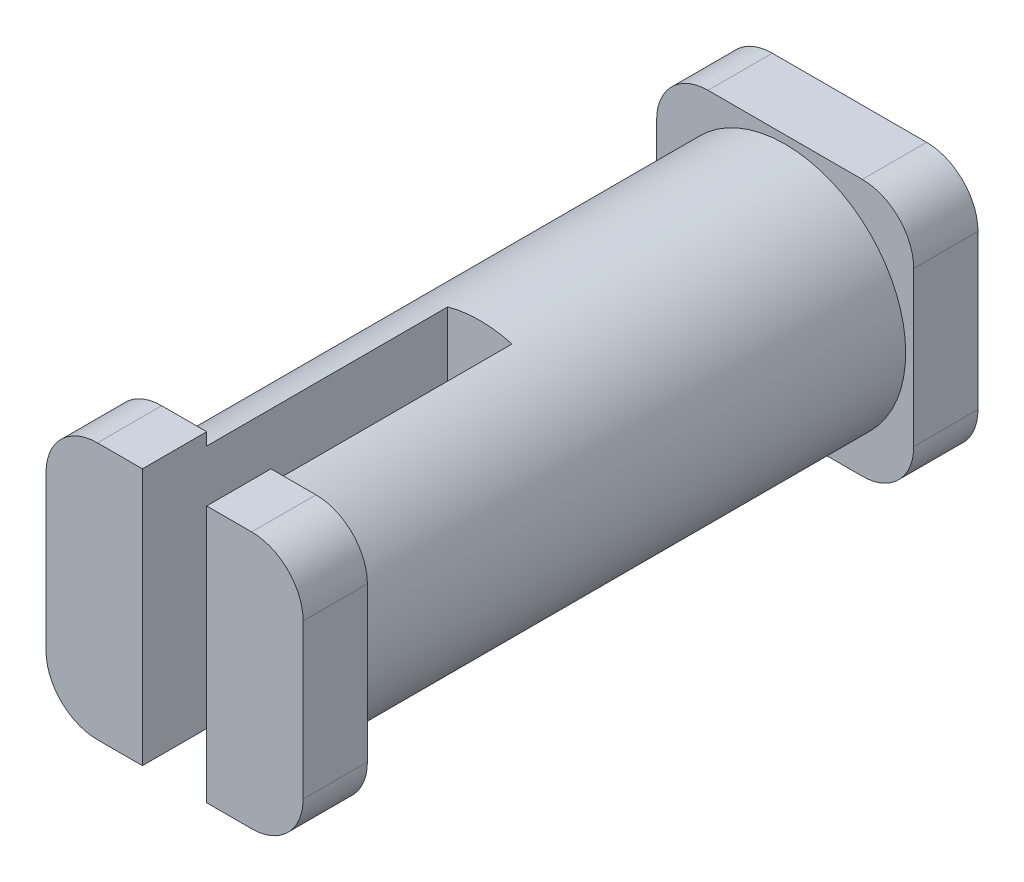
ISO-10303-21;
HEADER;
FILE_DESCRIPTION(('STEP AP214'),'2;1');
FILE_NAME('part.step','',(''),(''),'','','');
FILE_SCHEMA(('AUTOMOTIVE_DESIGN { 1 0 10303 214 1 1 1 1 }'));
ENDSEC;
DATA;
#1=APPLICATION_CONTEXT('core data for automotive mechanical design processes');
#2=APPLICATION_PROTOCOL_DEFINITION('international standard','automotive_design',2000,#1);
#3=PRODUCT_CONTEXT('',#1,'mechanical');
#4=PRODUCT('Part','Part','',(#3));
#5=PRODUCT_RELATED_PRODUCT_CATEGORY('part','',(#4));
#6=PRODUCT_DEFINITION_FORMATION('','',#4);
#7=PRODUCT_DEFINITION_CONTEXT('part definition',#1,'design');
#8=PRODUCT_DEFINITION('design','',#6,#7);
#9=PRODUCT_DEFINITION_SHAPE('','',#8);
#10=(LENGTH_UNIT() NAMED_UNIT(*) SI_UNIT(.MILLI.,.METRE.));
#11=(NAMED_UNIT(*) PLANE_ANGLE_UNIT() SI_UNIT($,.RADIAN.));
#12=(NAMED_UNIT(*) SI_UNIT($,.STERADIAN.) SOLID_ANGLE_UNIT());
#13=UNCERTAINTY_MEASURE_WITH_UNIT(LENGTH_MEASURE(1.E-05),#10,'distance_accuracy_value','');
#14=(GEOMETRIC_REPRESENTATION_CONTEXT(3) GLOBAL_UNCERTAINTY_ASSIGNED_CONTEXT((#13)) GLOBAL_UNIT_ASSIGNED_CONTEXT((#10,
#11,#12)) REPRESENTATION_CONTEXT('',''));
#15=CARTESIAN_POINT('',(0.,0.,0.));
#16=DIRECTION('',(0.,0.,1.));
#17=DIRECTION('',(1.,0.,0.));
#18=AXIS2_PLACEMENT_3D('',#15,#16,#17);
#19=CARTESIAN_POINT('',(1.27000000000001,0.,15.08125));
#20=DIRECTION('',(0.,-1.,0.));
#21=DIRECTION('',(0.,0.,-1.));
#22=AXIS2_PLACEMENT_3D('',#19,#20,#21);
#23=PLANE('',#22);
#24=DIRECTION('',(0.,0.,1.));
#25=VECTOR('',#24,1.);
#26=CARTESIAN_POINT('',(2.38125,0.,9.128125));
#27=LINE('',#26,#25);
#28=CARTESIAN_POINT('',(2.38125,0.,15.08125));
#29=VERTEX_POINT('',#28);
#30=CARTESIAN_POINT('',(2.38125,0.,16.66875));
#31=VERTEX_POINT('',#30);
#32=EDGE_CURVE('E259',#29,#31,#27,.T.);
#33=ORIENTED_EDGE('',*,*,#32,.T.);
#34=DIRECTION('',(1.,0.,0.));
#35=VECTOR('',#34,1.);
#36=CARTESIAN_POINT('',(1.27000000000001,0.,16.66875));
#37=LINE('',#36,#35);
#38=CARTESIAN_POINT('',(1.27000000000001,0.,16.66875));
#39=VERTEX_POINT('',#38);
#40=EDGE_CURVE('E304',#39,#31,#37,.T.);
#41=ORIENTED_EDGE('',*,*,#40,.F.);
#42=DIRECTION('',(0.,0.,1.));
#43=VECTOR('',#42,1.);
#44=CARTESIAN_POINT('',(1.27000000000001,0.,15.08125));
#45=LINE('',#44,#43);
#46=CARTESIAN_POINT('',(1.27000000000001,0.,15.08125));
#47=VERTEX_POINT('',#46);
#48=EDGE_CURVE('E342',#47,#39,#45,.T.);
#49=ORIENTED_EDGE('',*,*,#48,.F.);
#50=DIRECTION('',(1.,0.,0.));
#51=VECTOR('',#50,1.);
#52=CARTESIAN_POINT('',(1.27000000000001,0.,15.08125));
#53=LINE('',#52,#51);
#54=EDGE_CURVE('E273',#47,#29,#53,.T.);
#55=ORIENTED_EDGE('',*,*,#54,.T.);
#56=EDGE_LOOP('',(#33,#41,#49,#55));
#57=FACE_BOUND('',#56,.T.);
#58=ADVANCED_FACE('F36',(#57),#23,.T.);
#59=CARTESIAN_POINT('',(1.27,6.35,15.08125));
#60=DIRECTION('',(0.,1.,0.));
#61=DIRECTION('',(0.,0.,1.));
#62=AXIS2_PLACEMENT_3D('',#59,#60,#61);
#63=PLANE('',#62);
#64=DIRECTION('',(0.,0.,1.));
#65=VECTOR('',#64,1.);
#66=CARTESIAN_POINT('',(2.38125,6.35,9.128125));
#67=LINE('',#66,#65);
#68=CARTESIAN_POINT('',(2.38125,6.35,15.08125));
#69=VERTEX_POINT('',#68);
#70=CARTESIAN_POINT('',(2.38125,6.35,16.66875));
#71=VERTEX_POINT('',#70);
#72=EDGE_CURVE('E468',#69,#71,#67,.T.);
#73=ORIENTED_EDGE('',*,*,#72,.F.);
#74=DIRECTION('',(-1.,0.,0.));
#75=VECTOR('',#74,1.);
#76=CARTESIAN_POINT('',(1.27,6.35,15.08125));
#77=LINE('',#76,#75);
#78=CARTESIAN_POINT('',(1.27,6.35,15.08125));
#79=VERTEX_POINT('',#78);
#80=EDGE_CURVE('E289',#69,#79,#77,.T.);
#81=ORIENTED_EDGE('',*,*,#80,.T.);
#82=DIRECTION('',(0.,0.,1.));
#83=VECTOR('',#82,1.);
#84=CARTESIAN_POINT('',(1.27,6.35,15.08125));
#85=LINE('',#84,#83);
#86=CARTESIAN_POINT('',(1.27,6.35,16.66875));
#87=VERTEX_POINT('',#86);
#88=EDGE_CURVE('E333',#79,#87,#85,.T.);
#89=ORIENTED_EDGE('',*,*,#88,.T.);
#90=DIRECTION('',(-1.,0.,0.));
#91=VECTOR('',#90,1.);
#92=CARTESIAN_POINT('',(1.27,6.35,16.66875));
#93=LINE('',#92,#91);
#94=EDGE_CURVE('E316',#71,#87,#93,.T.);
#95=ORIENTED_EDGE('',*,*,#94,.F.);
#96=EDGE_LOOP('',(#73,#81,#89,#95));
#97=FACE_BOUND('',#96,.T.);
#98=ADVANCED_FACE('F219',(#97),#63,.T.);
#99=CARTESIAN_POINT('',(5.08,1.27,15.08125));
#100=DIRECTION('',(0.,0.,-1.));
#101=DIRECTION('',(1.,0.,0.));
#102=AXIS2_PLACEMENT_3D('',#99,#100,#101);
#103=PLANE('',#102);
#104=DIRECTION('',(0.,1.,0.));
#105=VECTOR('',#104,1.);
#106=CARTESIAN_POINT('',(2.38125,1.27,15.08125));
#107=LINE('',#106,#105);
#108=CARTESIAN_POINT('',(2.38125,0.306222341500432,15.08125));
#109=VERTEX_POINT('',#108);
#110=EDGE_CURVE('E356',#29,#109,#107,.T.);
#111=ORIENTED_EDGE('',*,*,#110,.F.);
#112=ORIENTED_EDGE('',*,*,#54,.F.);
#113=CARTESIAN_POINT('',(1.27,1.27,15.08125));
#114=DIRECTION('',(0.,0.,1.));
#115=DIRECTION('',(-1.,0.,0.));
#116=AXIS2_PLACEMENT_3D('',#113,#114,#115);
#117=CIRCLE('',#116,1.27);
#118=CARTESIAN_POINT('',(0.,1.27,15.08125));
#119=VERTEX_POINT('',#118);
#120=EDGE_CURVE('E276',#119,#47,#117,.T.);
#121=ORIENTED_EDGE('',*,*,#120,.F.);
#122=DIRECTION('',(0.,-1.,0.));
#123=VECTOR('',#122,1.);
#124=CARTESIAN_POINT('',(0.,1.27000000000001,15.08125));
#125=LINE('',#124,#123);
#126=CARTESIAN_POINT('',(0.,5.08,15.08125));
#127=VERTEX_POINT('',#126);
#128=EDGE_CURVE('E283',#127,#119,#125,.T.);
#129=ORIENTED_EDGE('',*,*,#128,.F.);
#130=CARTESIAN_POINT('',(1.27,5.08,15.08125));
#131=DIRECTION('',(0.,0.,1.));
#132=DIRECTION('',(-1.,0.,0.));
#133=AXIS2_PLACEMENT_3D('',#130,#131,#132);
#134=CIRCLE('',#133,1.27);
#135=EDGE_CURVE('E286',#79,#127,#134,.T.);
#136=ORIENTED_EDGE('',*,*,#135,.F.);
#137=ORIENTED_EDGE('',*,*,#80,.F.);
#138=CARTESIAN_POINT('',(2.38125,6.04377765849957,15.08125));
#139=VERTEX_POINT('',#138);
#140=EDGE_CURVE('E360',#139,#69,#107,.T.);
#141=ORIENTED_EDGE('',*,*,#140,.F.);
#142=CARTESIAN_POINT('',(3.175,3.175,15.08125));
#143=DIRECTION('',(0.,0.,1.));
#144=DIRECTION('',(1.,0.,0.));
#145=AXIS2_PLACEMENT_3D('',#142,#143,#144);
#146=CIRCLE('',#145,2.9765625);
#147=EDGE_CURVE('E150',#139,#109,#146,.T.);
#148=ORIENTED_EDGE('',*,*,#147,.T.);
#149=EDGE_LOOP('',(#111,#112,#121,#129,#136,#137,#141,#148));
#150=FACE_BOUND('',#149,.T.);
#151=ADVANCED_FACE('F226',(#150),#103,.T.);
#152=CARTESIAN_POINT('',(5.08,1.27,16.66875));
#153=DIRECTION('',(0.,0.,-1.));
#154=DIRECTION('',(1.,0.,0.));
#155=AXIS2_PLACEMENT_3D('',#152,#153,#154);
#156=PLANE('',#155);
#157=ORIENTED_EDGE('',*,*,#40,.T.);
#158=DIRECTION('',(0.,-1.,0.));
#159=VECTOR('',#158,1.);
#160=CARTESIAN_POINT('',(2.38125,6.35,16.66875));
#161=LINE('',#160,#159);
#162=EDGE_CURVE('E455',#71,#31,#161,.T.);
#163=ORIENTED_EDGE('',*,*,#162,.F.);
#164=ORIENTED_EDGE('',*,*,#94,.T.);
#165=CARTESIAN_POINT('',(1.27,5.08,16.66875));
#166=DIRECTION('',(0.,0.,1.));
#167=DIRECTION('',(-1.,0.,0.));
#168=AXIS2_PLACEMENT_3D('',#165,#166,#167);
#169=CIRCLE('',#168,1.27);
#170=CARTESIAN_POINT('',(0.,5.08,16.66875));
#171=VERTEX_POINT('',#170);
#172=EDGE_CURVE('E313',#87,#171,#169,.T.);
#173=ORIENTED_EDGE('',*,*,#172,.T.);
#174=DIRECTION('',(0.,-1.,0.));
#175=VECTOR('',#174,1.);
#176=CARTESIAN_POINT('',(0.,1.27000000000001,16.66875));
#177=LINE('',#176,#175);
#178=CARTESIAN_POINT('',(0.,1.27,16.66875));
#179=VERTEX_POINT('',#178);
#180=EDGE_CURVE('E310',#171,#179,#177,.T.);
#181=ORIENTED_EDGE('',*,*,#180,.T.);
#182=CARTESIAN_POINT('',(1.27,1.27,16.66875));
#183=DIRECTION('',(0.,0.,1.));
#184=DIRECTION('',(-1.,0.,0.));
#185=AXIS2_PLACEMENT_3D('',#182,#183,#184);
#186=CIRCLE('',#185,1.27);
#187=EDGE_CURVE('E307',#179,#39,#186,.T.);
#188=ORIENTED_EDGE('',*,*,#187,.T.);
#189=EDGE_LOOP('',(#157,#163,#164,#173,#181,#188));
#190=FACE_BOUND('',#189,.T.);
#191=ADVANCED_FACE('F444',(#190),#156,.F.);
#192=CARTESIAN_POINT('',(5.08,1.27,1.5875));
#193=DIRECTION('',(0.,0.,-1.));
#194=DIRECTION('',(-1.,0.,0.));
#195=AXIS2_PLACEMENT_3D('',#192,#193,#194);
#196=CYLINDRICAL_SURFACE('',#195,1.27);
#197=CARTESIAN_POINT('',(5.08,1.27,0.));
#198=DIRECTION('',(0.,0.,1.));
#199=DIRECTION('',(1.,0.,0.));
#200=AXIS2_PLACEMENT_3D('',#197,#198,#199);
#201=CIRCLE('',#200,1.27);
#202=CARTESIAN_POINT('',(5.08,0.,0.));
#203=VERTEX_POINT('',#202);
#204=CARTESIAN_POINT('',(6.35,1.27,0.));
#205=VERTEX_POINT('',#204);
#206=EDGE_CURVE('E146',#203,#205,#201,.T.);
#207=ORIENTED_EDGE('',*,*,#206,.T.);
#208=DIRECTION('',(0.,0.,-1.));
#209=VECTOR('',#208,1.);
#210=CARTESIAN_POINT('',(6.35,1.27,1.5875));
#211=LINE('',#210,#209);
#212=CARTESIAN_POINT('',(6.35,1.27,1.5875));
#213=VERTEX_POINT('',#212);
#214=EDGE_CURVE('E174',#213,#205,#211,.T.);
#215=ORIENTED_EDGE('',*,*,#214,.F.);
#216=CARTESIAN_POINT('',(5.08,1.27,1.5875));
#217=DIRECTION('',(0.,0.,1.));
#218=DIRECTION('',(1.,0.,0.));
#219=AXIS2_PLACEMENT_3D('',#216,#217,#218);
#220=CIRCLE('',#219,1.27);
#221=CARTESIAN_POINT('',(5.08,0.,1.5875));
#222=VERTEX_POINT('',#221);
#223=EDGE_CURVE('E162',#222,#213,#220,.T.);
#224=ORIENTED_EDGE('',*,*,#223,.F.);
#225=DIRECTION('',(0.,0.,-1.));
#226=VECTOR('',#225,1.);
#227=CARTESIAN_POINT('',(5.08,0.,1.5875));
#228=LINE('',#227,#226);
#229=EDGE_CURVE('E142',#222,#203,#228,.T.);
#230=ORIENTED_EDGE('',*,*,#229,.T.);
#231=EDGE_LOOP('',(#207,#215,#224,#230));
#232=FACE_BOUND('',#231,.T.);
#233=ADVANCED_FACE('F38',(#232),#196,.T.);
#234=CARTESIAN_POINT('',(6.35,1.27,1.5875));
#235=DIRECTION('',(-1.,0.,0.));
#236=DIRECTION('',(0.,-1.,0.));
#237=AXIS2_PLACEMENT_3D('',#234,#235,#236);
#238=PLANE('',#237);
#239=DIRECTION('',(0.,1.,0.));
#240=VECTOR('',#239,1.);
#241=CARTESIAN_POINT('',(6.35,1.27,0.));
#242=LINE('',#241,#240);
#243=CARTESIAN_POINT('',(6.35,5.08,0.));
#244=VERTEX_POINT('',#243);
#245=EDGE_CURVE('E149',#205,#244,#242,.T.);
#246=ORIENTED_EDGE('',*,*,#245,.T.);
#247=DIRECTION('',(0.,0.,-1.));
#248=VECTOR('',#247,1.);
#249=CARTESIAN_POINT('',(6.35,5.08,1.5875));
#250=LINE('',#249,#248);
#251=CARTESIAN_POINT('',(6.35,5.08,1.5875));
#252=VERTEX_POINT('',#251);
#253=EDGE_CURVE('E172',#252,#244,#250,.T.);
#254=ORIENTED_EDGE('',*,*,#253,.F.);
#255=DIRECTION('',(0.,1.,0.));
#256=VECTOR('',#255,1.);
#257=CARTESIAN_POINT('',(6.35,1.27,1.5875));
#258=LINE('',#257,#256);
#259=EDGE_CURVE('E102',#213,#252,#258,.T.);
#260=ORIENTED_EDGE('',*,*,#259,.F.);
#261=ORIENTED_EDGE('',*,*,#214,.T.);
#262=EDGE_LOOP('',(#246,#254,#260,#261));
#263=FACE_BOUND('',#262,.T.);
#264=ADVANCED_FACE('F207',(#263),#238,.F.);
#265=CARTESIAN_POINT('',(5.08,5.08,1.5875));
#266=DIRECTION('',(0.,0.,-1.));
#267=DIRECTION('',(-1.,0.,0.));
#268=AXIS2_PLACEMENT_3D('',#265,#266,#267);
#269=CYLINDRICAL_SURFACE('',#268,1.27);
#270=CARTESIAN_POINT('',(5.08,5.08,0.));
#271=DIRECTION('',(0.,0.,1.));
#272=DIRECTION('',(-1.,0.,0.));
#273=AXIS2_PLACEMENT_3D('',#270,#271,#272);
#274=CIRCLE('',#273,1.27);
#275=CARTESIAN_POINT('',(5.08,6.35,0.));
#276=VERTEX_POINT('',#275);
#277=EDGE_CURVE('E152',#244,#276,#274,.T.);
#278=ORIENTED_EDGE('',*,*,#277,.T.);
#279=DIRECTION('',(0.,0.,-1.));
#280=VECTOR('',#279,1.);
#281=CARTESIAN_POINT('',(5.08,6.35,1.5875));
#282=LINE('',#281,#280);
#283=CARTESIAN_POINT('',(5.08,6.35,1.5875));
#284=VERTEX_POINT('',#283);
#285=EDGE_CURVE('E169',#284,#276,#282,.T.);
#286=ORIENTED_EDGE('',*,*,#285,.F.);
#287=CARTESIAN_POINT('',(5.08,5.08,1.5875));
#288=DIRECTION('',(0.,0.,1.));
#289=DIRECTION('',(-1.,0.,0.));
#290=AXIS2_PLACEMENT_3D('',#287,#288,#289);
#291=CIRCLE('',#290,1.27);
#292=EDGE_CURVE('E188',#252,#284,#291,.T.);
#293=ORIENTED_EDGE('',*,*,#292,.F.);
#294=ORIENTED_EDGE('',*,*,#253,.T.);
#295=EDGE_LOOP('',(#278,#286,#293,#294));
#296=FACE_BOUND('',#295,.T.);
#297=ADVANCED_FACE('F210',(#296),#269,.T.);
#298=CARTESIAN_POINT('',(1.27,6.35,1.5875));
#299=DIRECTION('',(0.,-1.,0.));
#300=DIRECTION('',(0.,0.,-1.));
#301=AXIS2_PLACEMENT_3D('',#298,#299,#300);
#302=PLANE('',#301);
#303=DIRECTION('',(-1.,0.,0.));
#304=VECTOR('',#303,1.);
#305=CARTESIAN_POINT('',(1.27,6.35,0.));
#306=LINE('',#305,#304);
#307=CARTESIAN_POINT('',(1.27,6.35,0.));
#308=VERTEX_POINT('',#307);
#309=EDGE_CURVE('E154',#276,#308,#306,.T.);
#310=ORIENTED_EDGE('',*,*,#309,.T.);
#311=DIRECTION('',(0.,0.,-1.));
#312=VECTOR('',#311,1.);
#313=CARTESIAN_POINT('',(1.27,6.35,1.5875));
#314=LINE('',#313,#312);
#315=CARTESIAN_POINT('',(1.27,6.35,1.5875));
#316=VERTEX_POINT('',#315);
#317=EDGE_CURVE('E166',#316,#308,#314,.T.);
#318=ORIENTED_EDGE('',*,*,#317,.F.);
#319=DIRECTION('',(-1.,0.,0.));
#320=VECTOR('',#319,1.);
#321=CARTESIAN_POINT('',(1.27,6.35,1.5875));
#322=LINE('',#321,#320);
#323=EDGE_CURVE('E190',#284,#316,#322,.T.);
#324=ORIENTED_EDGE('',*,*,#323,.F.);
#325=ORIENTED_EDGE('',*,*,#285,.T.);
#326=EDGE_LOOP('',(#310,#318,#324,#325));
#327=FACE_BOUND('',#326,.T.);
#328=ADVANCED_FACE('F196',(#327),#302,.F.);
#329=CARTESIAN_POINT('',(1.27,5.08,1.5875));
#330=DIRECTION('',(0.,0.,-1.));
#331=DIRECTION('',(-1.,0.,0.));
#332=AXIS2_PLACEMENT_3D('',#329,#330,#331);
#333=CYLINDRICAL_SURFACE('',#332,1.27);
#334=CARTESIAN_POINT('',(1.27,5.08,0.));
#335=DIRECTION('',(0.,0.,1.));
#336=DIRECTION('',(-1.,0.,0.));
#337=AXIS2_PLACEMENT_3D('',#334,#335,#336);
#338=CIRCLE('',#337,1.27);
#339=CARTESIAN_POINT('',(0.,5.08,0.));
#340=VERTEX_POINT('',#339);
#341=EDGE_CURVE('E156',#308,#340,#338,.T.);
#342=ORIENTED_EDGE('',*,*,#341,.T.);
#343=DIRECTION('',(0.,0.,-1.));
#344=VECTOR('',#343,1.);
#345=CARTESIAN_POINT('',(0.,5.08,1.5875));
#346=LINE('',#345,#344);
#347=CARTESIAN_POINT('',(0.,5.08,1.5875));
#348=VERTEX_POINT('',#347);
#349=EDGE_CURVE('E137',#348,#340,#346,.T.);
#350=ORIENTED_EDGE('',*,*,#349,.F.);
#351=CARTESIAN_POINT('',(1.27,5.08,1.5875));
#352=DIRECTION('',(0.,0.,1.));
#353=DIRECTION('',(-1.,0.,0.));
#354=AXIS2_PLACEMENT_3D('',#351,#352,#353);
#355=CIRCLE('',#354,1.27);
#356=EDGE_CURVE('E125',#316,#348,#355,.T.);
#357=ORIENTED_EDGE('',*,*,#356,.F.);
#358=ORIENTED_EDGE('',*,*,#317,.T.);
#359=EDGE_LOOP('',(#342,#350,#357,#358));
#360=FACE_BOUND('',#359,.T.);
#361=ADVANCED_FACE('F200',(#360),#333,.T.);
#362=CARTESIAN_POINT('',(0.,1.27000000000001,1.5875));
#363=DIRECTION('',(1.,0.,0.));
#364=DIRECTION('',(0.,1.,0.));
#365=AXIS2_PLACEMENT_3D('',#362,#363,#364);
#366=PLANE('',#365);
#367=DIRECTION('',(0.,-1.,0.));
#368=VECTOR('',#367,1.);
#369=CARTESIAN_POINT('',(0.,1.27000000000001,0.));
#370=LINE('',#369,#368);
#371=CARTESIAN_POINT('',(0.,1.27,0.));
#372=VERTEX_POINT('',#371);
#373=EDGE_CURVE('E134',#340,#372,#370,.T.);
#374=ORIENTED_EDGE('',*,*,#373,.T.);
#375=DIRECTION('',(0.,0.,-1.));
#376=VECTOR('',#375,1.);
#377=CARTESIAN_POINT('',(0.,1.27,1.5875));
#378=LINE('',#377,#376);
#379=CARTESIAN_POINT('',(0.,1.27,1.5875));
#380=VERTEX_POINT('',#379);
#381=EDGE_CURVE('E131',#380,#372,#378,.T.);
#382=ORIENTED_EDGE('',*,*,#381,.F.);
#383=DIRECTION('',(0.,-1.,0.));
#384=VECTOR('',#383,1.);
#385=CARTESIAN_POINT('',(0.,1.27000000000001,1.5875));
#386=LINE('',#385,#384);
#387=EDGE_CURVE('E118',#348,#380,#386,.T.);
#388=ORIENTED_EDGE('',*,*,#387,.F.);
#389=ORIENTED_EDGE('',*,*,#349,.T.);
#390=EDGE_LOOP('',(#374,#382,#388,#389));
#391=FACE_BOUND('',#390,.T.);
#392=ADVANCED_FACE('F132',(#391),#366,.F.);
#393=CARTESIAN_POINT('',(1.27,1.27,1.5875));
#394=DIRECTION('',(0.,0.,-1.));
#395=DIRECTION('',(-1.,0.,0.));
#396=AXIS2_PLACEMENT_3D('',#393,#394,#395);
#397=CYLINDRICAL_SURFACE('',#396,1.27);
#398=CARTESIAN_POINT('',(1.27,1.27,0.));
#399=DIRECTION('',(0.,0.,1.));
#400=DIRECTION('',(-1.,0.,0.));
#401=AXIS2_PLACEMENT_3D('',#398,#399,#400);
#402=CIRCLE('',#401,1.27);
#403=CARTESIAN_POINT('',(1.27000000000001,0.,0.));
#404=VERTEX_POINT('',#403);
#405=EDGE_CURVE('E159',#372,#404,#402,.T.);
#406=ORIENTED_EDGE('',*,*,#405,.T.);
#407=DIRECTION('',(0.,0.,-1.));
#408=VECTOR('',#407,1.);
#409=CARTESIAN_POINT('',(1.27000000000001,0.,1.5875));
#410=LINE('',#409,#408);
#411=CARTESIAN_POINT('',(1.27000000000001,0.,1.5875));
#412=VERTEX_POINT('',#411);
#413=EDGE_CURVE('E138',#412,#404,#410,.T.);
#414=ORIENTED_EDGE('',*,*,#413,.F.);
#415=CARTESIAN_POINT('',(1.27,1.27,1.5875));
#416=DIRECTION('',(0.,0.,1.));
#417=DIRECTION('',(-1.,0.,0.));
#418=AXIS2_PLACEMENT_3D('',#415,#416,#417);
#419=CIRCLE('',#418,1.27);
#420=EDGE_CURVE('E122',#380,#412,#419,.T.);
#421=ORIENTED_EDGE('',*,*,#420,.F.);
#422=ORIENTED_EDGE('',*,*,#381,.T.);
#423=EDGE_LOOP('',(#406,#414,#421,#422));
#424=FACE_BOUND('',#423,.T.);
#425=ADVANCED_FACE('F140',(#424),#397,.T.);
#426=CARTESIAN_POINT('',(1.27000000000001,0.,1.5875));
#427=DIRECTION('',(0.,1.,0.));
#428=DIRECTION('',(0.,0.,1.));
#429=AXIS2_PLACEMENT_3D('',#426,#427,#428);
#430=PLANE('',#429);
#431=DIRECTION('',(1.,0.,0.));
#432=VECTOR('',#431,1.);
#433=CARTESIAN_POINT('',(1.27000000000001,0.,0.));
#434=LINE('',#433,#432);
#435=EDGE_CURVE('E93',#404,#203,#434,.T.);
#436=ORIENTED_EDGE('',*,*,#435,.T.);
#437=ORIENTED_EDGE('',*,*,#229,.F.);
#438=DIRECTION('',(1.,0.,0.));
#439=VECTOR('',#438,1.);
#440=CARTESIAN_POINT('',(1.27000000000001,0.,1.5875));
#441=LINE('',#440,#439);
#442=EDGE_CURVE('E60',#412,#222,#441,.T.);
#443=ORIENTED_EDGE('',*,*,#442,.F.);
#444=ORIENTED_EDGE('',*,*,#413,.T.);
#445=EDGE_LOOP('',(#436,#437,#443,#444));
#446=FACE_BOUND('',#445,.T.);
#447=ADVANCED_FACE('F204',(#446),#430,.F.);
#448=CARTESIAN_POINT('',(5.08,1.27,1.5875));
#449=DIRECTION('',(0.,0.,1.));
#450=DIRECTION('',(1.,0.,0.));
#451=AXIS2_PLACEMENT_3D('',#448,#449,#450);
#452=PLANE('',#451);
#453=CARTESIAN_POINT('',(3.175,3.175,1.5875));
#454=DIRECTION('',(0.,0.,1.));
#455=DIRECTION('',(1.,0.,0.));
#456=AXIS2_PLACEMENT_3D('',#453,#454,#455);
#457=CIRCLE('',#456,2.9765625);
#458=CARTESIAN_POINT('',(6.1515625,3.175,1.5875));
#459=VERTEX_POINT('',#458);
#460=EDGE_CURVE('E175',#459,#459,#457,.T.);
#461=ORIENTED_EDGE('',*,*,#460,.F.);
#462=EDGE_LOOP('',(#461));
#463=FACE_BOUND('',#462,.T.);
#464=ORIENTED_EDGE('',*,*,#223,.T.);
#465=ORIENTED_EDGE('',*,*,#259,.T.);
#466=ORIENTED_EDGE('',*,*,#292,.T.);
#467=ORIENTED_EDGE('',*,*,#323,.T.);
#468=ORIENTED_EDGE('',*,*,#356,.T.);
#469=ORIENTED_EDGE('',*,*,#387,.T.);
#470=ORIENTED_EDGE('',*,*,#420,.T.);
#471=ORIENTED_EDGE('',*,*,#442,.T.);
#472=EDGE_LOOP('',(#464,#465,#466,#467,#468,#469,#470,#471));
#473=FACE_BOUND('',#472,.T.);
#474=ADVANCED_FACE('F120',(#463,#473),#452,.T.);
#475=CARTESIAN_POINT('',(5.08,1.27,0.));
#476=DIRECTION('',(0.,0.,1.));
#477=DIRECTION('',(1.,0.,0.));
#478=AXIS2_PLACEMENT_3D('',#475,#476,#477);
#479=PLANE('',#478);
#480=ORIENTED_EDGE('',*,*,#206,.F.);
#481=ORIENTED_EDGE('',*,*,#435,.F.);
#482=ORIENTED_EDGE('',*,*,#405,.F.);
#483=ORIENTED_EDGE('',*,*,#373,.F.);
#484=ORIENTED_EDGE('',*,*,#341,.F.);
#485=ORIENTED_EDGE('',*,*,#309,.F.);
#486=ORIENTED_EDGE('',*,*,#277,.F.);
#487=ORIENTED_EDGE('',*,*,#245,.F.);
#488=EDGE_LOOP('',(#480,#481,#482,#483,#484,#485,#486,#487));
#489=FACE_BOUND('',#488,.T.);
#490=ADVANCED_FACE('F203',(#489),#479,.F.);
#491=CARTESIAN_POINT('',(3.175,3.175,15.08125));
#492=DIRECTION('',(0.,0.,-1.));
#493=DIRECTION('',(-1.,0.,0.));
#494=AXIS2_PLACEMENT_3D('',#491,#492,#493);
#495=CYLINDRICAL_SURFACE('',#494,2.9765625);
#496=ORIENTED_EDGE('',*,*,#147,.F.);
#497=DIRECTION('',(0.,0.,-1.));
#498=VECTOR('',#497,1.);
#499=CARTESIAN_POINT('',(2.38125,6.04377765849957,15.08125));
#500=LINE('',#499,#498);
#501=CARTESIAN_POINT('',(2.38125,6.04377765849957,9.128125));
#502=VERTEX_POINT('',#501);
#503=EDGE_CURVE('E368',#139,#502,#500,.T.);
#504=ORIENTED_EDGE('',*,*,#503,.T.);
#505=CARTESIAN_POINT('',(3.175,3.175,9.128125));
#506=DIRECTION('',(0.,0.,1.));
#507=DIRECTION('',(1.,0.,0.));
#508=AXIS2_PLACEMENT_3D('',#505,#506,#507);
#509=CIRCLE('',#508,2.9765625);
#510=CARTESIAN_POINT('',(3.96875,6.04377765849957,9.128125));
#511=VERTEX_POINT('',#510);
#512=EDGE_CURVE('E11',#511,#502,#509,.T.);
#513=ORIENTED_EDGE('',*,*,#512,.F.);
#514=DIRECTION('',(0.,0.,-1.));
#515=VECTOR('',#514,1.);
#516=CARTESIAN_POINT('',(3.96875,6.04377765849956,15.08125));
#517=LINE('',#516,#515);
#518=CARTESIAN_POINT('',(3.96875,6.04377765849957,15.08125));
#519=VERTEX_POINT('',#518);
#520=EDGE_CURVE('E472',#511,#519,#517,.F.);
#521=ORIENTED_EDGE('',*,*,#520,.T.);
#522=CARTESIAN_POINT('',(3.96875,0.306222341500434,15.08125));
#523=VERTEX_POINT('',#522);
#524=EDGE_CURVE('E184',#523,#519,#146,.T.);
#525=ORIENTED_EDGE('',*,*,#524,.F.);
#526=DIRECTION('',(0.,0.,-1.));
#527=VECTOR('',#526,1.);
#528=CARTESIAN_POINT('',(3.96875,0.306222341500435,15.08125));
#529=LINE('',#528,#527);
#530=CARTESIAN_POINT('',(3.96875,0.306222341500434,9.128125));
#531=VERTEX_POINT('',#530);
#532=EDGE_CURVE('E467',#523,#531,#529,.T.);
#533=ORIENTED_EDGE('',*,*,#532,.T.);
#534=CARTESIAN_POINT('',(2.38125,0.306222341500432,9.128125));
#535=VERTEX_POINT('',#534);
#536=EDGE_CURVE('E40',#535,#531,#509,.T.);
#537=ORIENTED_EDGE('',*,*,#536,.F.);
#538=DIRECTION('',(0.,0.,-1.));
#539=VECTOR('',#538,1.);
#540=CARTESIAN_POINT('',(2.38125,0.306222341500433,15.08125));
#541=LINE('',#540,#539);
#542=EDGE_CURVE('E303',#535,#109,#541,.F.);
#543=ORIENTED_EDGE('',*,*,#542,.T.);
#544=EDGE_LOOP('',(#496,#504,#513,#521,#525,#533,#537,#543));
#545=FACE_BOUND('',#544,.T.);
#546=ORIENTED_EDGE('',*,*,#460,.T.);
#547=EDGE_LOOP('',(#546));
#548=FACE_BOUND('',#547,.T.);
#549=ADVANCED_FACE('F243',(#545,#548),#495,.T.);
#550=CARTESIAN_POINT('',(5.08,1.27,15.08125));
#551=DIRECTION('',(0.,0.,1.));
#552=DIRECTION('',(1.,0.,0.));
#553=AXIS2_PLACEMENT_3D('',#550,#551,#552);
#554=CYLINDRICAL_SURFACE('',#553,1.27);
#555=CARTESIAN_POINT('',(5.08,1.27,16.66875));
#556=DIRECTION('',(0.,0.,1.));
#557=DIRECTION('',(1.,0.,0.));
#558=AXIS2_PLACEMENT_3D('',#555,#556,#557);
#559=CIRCLE('',#558,1.27);
#560=CARTESIAN_POINT('',(5.08,0.,16.66875));
#561=VERTEX_POINT('',#560);
#562=CARTESIAN_POINT('',(6.35,1.27,16.66875));
#563=VERTEX_POINT('',#562);
#564=EDGE_CURVE('E300',#561,#563,#559,.T.);
#565=ORIENTED_EDGE('',*,*,#564,.F.);
#566=DIRECTION('',(0.,0.,1.));
#567=VECTOR('',#566,1.);
#568=CARTESIAN_POINT('',(5.08,0.,15.08125));
#569=LINE('',#568,#567);
#570=CARTESIAN_POINT('',(5.08,0.,15.08125));
#571=VERTEX_POINT('',#570);
#572=EDGE_CURVE('E344',#571,#561,#569,.T.);
#573=ORIENTED_EDGE('',*,*,#572,.F.);
#574=CARTESIAN_POINT('',(5.08,1.27,15.08125));
#575=DIRECTION('',(0.,0.,1.));
#576=DIRECTION('',(1.,0.,0.));
#577=AXIS2_PLACEMENT_3D('',#574,#575,#576);
#578=CIRCLE('',#577,1.27);
#579=CARTESIAN_POINT('',(6.35,1.27,15.08125));
#580=VERTEX_POINT('',#579);
#581=EDGE_CURVE('E272',#571,#580,#578,.T.);
#582=ORIENTED_EDGE('',*,*,#581,.T.);
#583=DIRECTION('',(0.,0.,1.));
#584=VECTOR('',#583,1.);
#585=CARTESIAN_POINT('',(6.35,1.27,15.08125));
#586=LINE('',#585,#584);
#587=EDGE_CURVE('E299',#580,#563,#586,.T.);
#588=ORIENTED_EDGE('',*,*,#587,.T.);
#589=EDGE_LOOP('',(#565,#573,#582,#588));
#590=FACE_BOUND('',#589,.T.);
#591=ADVANCED_FACE('F235',(#590),#554,.T.);
#592=DIRECTION('',(0.,0.,1.));
#593=VECTOR('',#592,1.);
#594=CARTESIAN_POINT('',(3.96875,0.,9.128125));
#595=LINE('',#594,#593);
#596=CARTESIAN_POINT('',(3.96875,0.,15.08125));
#597=VERTEX_POINT('',#596);
#598=CARTESIAN_POINT('',(3.96875,0.,16.66875));
#599=VERTEX_POINT('',#598);
#600=EDGE_CURVE('E51',#597,#599,#595,.T.);
#601=ORIENTED_EDGE('',*,*,#600,.F.);
#602=EDGE_CURVE('E251',#597,#571,#53,.T.);
#603=ORIENTED_EDGE('',*,*,#602,.T.);
#604=ORIENTED_EDGE('',*,*,#572,.T.);
#605=EDGE_CURVE('E254',#599,#561,#37,.T.);
#606=ORIENTED_EDGE('',*,*,#605,.F.);
#607=EDGE_LOOP('',(#601,#603,#604,#606));
#608=FACE_BOUND('',#607,.T.);
#609=ADVANCED_FACE('F222',(#608),#23,.T.);
#610=CARTESIAN_POINT('',(1.27,1.27,15.08125));
#611=DIRECTION('',(0.,0.,1.));
#612=DIRECTION('',(1.,0.,0.));
#613=AXIS2_PLACEMENT_3D('',#610,#611,#612);
#614=CYLINDRICAL_SURFACE('',#613,1.27);
#615=ORIENTED_EDGE('',*,*,#187,.F.);
#616=DIRECTION('',(0.,0.,1.));
#617=VECTOR('',#616,1.);
#618=CARTESIAN_POINT('',(0.,1.27,15.08125));
#619=LINE('',#618,#617);
#620=EDGE_CURVE('E339',#119,#179,#619,.T.);
#621=ORIENTED_EDGE('',*,*,#620,.F.);
#622=ORIENTED_EDGE('',*,*,#120,.T.);
#623=ORIENTED_EDGE('',*,*,#48,.T.);
#624=EDGE_LOOP('',(#615,#621,#622,#623));
#625=FACE_BOUND('',#624,.T.);
#626=ADVANCED_FACE('F234',(#625),#614,.T.);
#627=CARTESIAN_POINT('',(0.,1.27000000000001,15.08125));
#628=DIRECTION('',(-1.,0.,0.));
#629=DIRECTION('',(0.,-1.,0.));
#630=AXIS2_PLACEMENT_3D('',#627,#628,#629);
#631=PLANE('',#630);
#632=ORIENTED_EDGE('',*,*,#180,.F.);
#633=DIRECTION('',(0.,0.,1.));
#634=VECTOR('',#633,1.);
#635=CARTESIAN_POINT('',(0.,5.08,15.08125));
#636=LINE('',#635,#634);
#637=EDGE_CURVE('E336',#127,#171,#636,.T.);
#638=ORIENTED_EDGE('',*,*,#637,.F.);
#639=ORIENTED_EDGE('',*,*,#128,.T.);
#640=ORIENTED_EDGE('',*,*,#620,.T.);
#641=EDGE_LOOP('',(#632,#638,#639,#640));
#642=FACE_BOUND('',#641,.T.);
#643=ADVANCED_FACE('F241',(#642),#631,.T.);
#644=CARTESIAN_POINT('',(1.27,5.08,15.08125));
#645=DIRECTION('',(0.,0.,1.));
#646=DIRECTION('',(1.,0.,0.));
#647=AXIS2_PLACEMENT_3D('',#644,#645,#646);
#648=CYLINDRICAL_SURFACE('',#647,1.27);
#649=ORIENTED_EDGE('',*,*,#172,.F.);
#650=ORIENTED_EDGE('',*,*,#88,.F.);
#651=ORIENTED_EDGE('',*,*,#135,.T.);
#652=ORIENTED_EDGE('',*,*,#637,.T.);
#653=EDGE_LOOP('',(#649,#650,#651,#652));
#654=FACE_BOUND('',#653,.T.);
#655=ADVANCED_FACE('F430',(#654),#648,.T.);
#656=DIRECTION('',(0.,0.,1.));
#657=VECTOR('',#656,1.);
#658=CARTESIAN_POINT('',(3.96875,6.35,9.128125));
#659=LINE('',#658,#657);
#660=CARTESIAN_POINT('',(3.96875,6.35,15.08125));
#661=VERTEX_POINT('',#660);
#662=CARTESIAN_POINT('',(3.96875,6.35,16.66875));
#663=VERTEX_POINT('',#662);
#664=EDGE_CURVE('E258',#661,#663,#659,.T.);
#665=ORIENTED_EDGE('',*,*,#664,.T.);
#666=CARTESIAN_POINT('',(5.08,6.35,16.66875));
#667=VERTEX_POINT('',#666);
#668=EDGE_CURVE('E317',#667,#663,#93,.T.);
#669=ORIENTED_EDGE('',*,*,#668,.F.);
#670=DIRECTION('',(0.,0.,1.));
#671=VECTOR('',#670,1.);
#672=CARTESIAN_POINT('',(5.08,6.35,15.08125));
#673=LINE('',#672,#671);
#674=CARTESIAN_POINT('',(5.08,6.35,15.08125));
#675=VERTEX_POINT('',#674);
#676=EDGE_CURVE('E330',#675,#667,#673,.T.);
#677=ORIENTED_EDGE('',*,*,#676,.F.);
#678=EDGE_CURVE('E290',#675,#661,#77,.T.);
#679=ORIENTED_EDGE('',*,*,#678,.T.);
#680=EDGE_LOOP('',(#665,#669,#677,#679));
#681=FACE_BOUND('',#680,.T.);
#682=ADVANCED_FACE('F229',(#681),#63,.T.);
#683=CARTESIAN_POINT('',(5.08,5.08,15.08125));
#684=DIRECTION('',(0.,0.,1.));
#685=DIRECTION('',(1.,0.,0.));
#686=AXIS2_PLACEMENT_3D('',#683,#684,#685);
#687=CYLINDRICAL_SURFACE('',#686,1.27);
#688=CARTESIAN_POINT('',(5.08,5.08,16.66875));
#689=DIRECTION('',(0.,0.,1.));
#690=DIRECTION('',(-1.,0.,0.));
#691=AXIS2_PLACEMENT_3D('',#688,#689,#690);
#692=CIRCLE('',#691,1.27);
#693=CARTESIAN_POINT('',(6.35,5.08,16.66875));
#694=VERTEX_POINT('',#693);
#695=EDGE_CURVE('E320',#694,#667,#692,.T.);
#696=ORIENTED_EDGE('',*,*,#695,.F.);
#697=DIRECTION('',(0.,0.,1.));
#698=VECTOR('',#697,1.);
#699=CARTESIAN_POINT('',(6.35,5.08,15.08125));
#700=LINE('',#699,#698);
#701=CARTESIAN_POINT('',(6.35,5.08,15.08125));
#702=VERTEX_POINT('',#701);
#703=EDGE_CURVE('E327',#702,#694,#700,.T.);
#704=ORIENTED_EDGE('',*,*,#703,.F.);
#705=CARTESIAN_POINT('',(5.08,5.08,15.08125));
#706=DIRECTION('',(0.,0.,1.));
#707=DIRECTION('',(-1.,0.,0.));
#708=AXIS2_PLACEMENT_3D('',#705,#706,#707);
#709=CIRCLE('',#708,1.27);
#710=EDGE_CURVE('E293',#702,#675,#709,.T.);
#711=ORIENTED_EDGE('',*,*,#710,.T.);
#712=ORIENTED_EDGE('',*,*,#676,.T.);
#713=EDGE_LOOP('',(#696,#704,#711,#712));
#714=FACE_BOUND('',#713,.T.);
#715=ADVANCED_FACE('F418',(#714),#687,.T.);
#716=CARTESIAN_POINT('',(6.35,1.27,15.08125));
#717=DIRECTION('',(1.,0.,0.));
#718=DIRECTION('',(0.,1.,0.));
#719=AXIS2_PLACEMENT_3D('',#716,#717,#718);
#720=PLANE('',#719);
#721=DIRECTION('',(0.,1.,0.));
#722=VECTOR('',#721,1.);
#723=CARTESIAN_POINT('',(6.35,1.27,16.66875));
#724=LINE('',#723,#722);
#725=EDGE_CURVE('E277',#563,#694,#724,.T.);
#726=ORIENTED_EDGE('',*,*,#725,.F.);
#727=ORIENTED_EDGE('',*,*,#587,.F.);
#728=DIRECTION('',(0.,1.,0.));
#729=VECTOR('',#728,1.);
#730=CARTESIAN_POINT('',(6.35,1.27,15.08125));
#731=LINE('',#730,#729);
#732=EDGE_CURVE('E296',#580,#702,#731,.T.);
#733=ORIENTED_EDGE('',*,*,#732,.T.);
#734=ORIENTED_EDGE('',*,*,#703,.T.);
#735=EDGE_LOOP('',(#726,#727,#733,#734));
#736=FACE_BOUND('',#735,.T.);
#737=ADVANCED_FACE('F416',(#736),#720,.T.);
#738=DIRECTION('',(0.,-1.,0.));
#739=VECTOR('',#738,1.);
#740=CARTESIAN_POINT('',(3.96875,1.27,15.08125));
#741=LINE('',#740,#739);
#742=EDGE_CURVE('E469',#661,#519,#741,.T.);
#743=ORIENTED_EDGE('',*,*,#742,.F.);
#744=ORIENTED_EDGE('',*,*,#678,.F.);
#745=ORIENTED_EDGE('',*,*,#710,.F.);
#746=ORIENTED_EDGE('',*,*,#732,.F.);
#747=ORIENTED_EDGE('',*,*,#581,.F.);
#748=ORIENTED_EDGE('',*,*,#602,.F.);
#749=EDGE_CURVE('E268',#523,#597,#741,.T.);
#750=ORIENTED_EDGE('',*,*,#749,.F.);
#751=ORIENTED_EDGE('',*,*,#524,.T.);
#752=EDGE_LOOP('',(#743,#744,#745,#746,#747,#748,#750,#751));
#753=FACE_BOUND('',#752,.T.);
#754=ADVANCED_FACE('F265',(#753),#103,.T.);
#755=ORIENTED_EDGE('',*,*,#668,.T.);
#756=DIRECTION('',(0.,1.,0.));
#757=VECTOR('',#756,1.);
#758=CARTESIAN_POINT('',(3.96875,6.35,16.66875));
#759=LINE('',#758,#757);
#760=EDGE_CURVE('E481',#599,#663,#759,.T.);
#761=ORIENTED_EDGE('',*,*,#760,.F.);
#762=ORIENTED_EDGE('',*,*,#605,.T.);
#763=ORIENTED_EDGE('',*,*,#564,.T.);
#764=ORIENTED_EDGE('',*,*,#725,.T.);
#765=ORIENTED_EDGE('',*,*,#695,.T.);
#766=EDGE_LOOP('',(#755,#761,#762,#763,#764,#765));
#767=FACE_BOUND('',#766,.T.);
#768=ADVANCED_FACE('F415',(#767),#156,.F.);
#769=CARTESIAN_POINT('',(0.,0.,9.128125));
#770=DIRECTION('',(0.,0.,1.));
#771=DIRECTION('',(1.,0.,0.));
#772=AXIS2_PLACEMENT_3D('',#769,#770,#771);
#773=PLANE('',#772);
#774=ORIENTED_EDGE('',*,*,#512,.T.);
#775=DIRECTION('',(0.,-1.,0.));
#776=VECTOR('',#775,1.);
#777=CARTESIAN_POINT('',(2.38125,6.35,9.128125));
#778=LINE('',#777,#776);
#779=EDGE_CURVE('E462',#502,#535,#778,.T.);
#780=ORIENTED_EDGE('',*,*,#779,.T.);
#781=ORIENTED_EDGE('',*,*,#536,.T.);
#782=DIRECTION('',(0.,1.,0.));
#783=VECTOR('',#782,1.);
#784=CARTESIAN_POINT('',(3.96875,6.35,9.128125));
#785=LINE('',#784,#783);
#786=EDGE_CURVE('E459',#531,#511,#785,.T.);
#787=ORIENTED_EDGE('',*,*,#786,.T.);
#788=EDGE_LOOP('',(#774,#780,#781,#787));
#789=FACE_BOUND('',#788,.T.);
#790=ADVANCED_FACE('F479',(#789),#773,.T.);
#791=CARTESIAN_POINT('',(2.38125,6.35,9.128125));
#792=DIRECTION('',(-1.,0.,0.));
#793=DIRECTION('',(0.,-1.,0.));
#794=AXIS2_PLACEMENT_3D('',#791,#792,#793);
#795=PLANE('',#794);
#796=ORIENTED_EDGE('',*,*,#779,.F.);
#797=ORIENTED_EDGE('',*,*,#503,.F.);
#798=ORIENTED_EDGE('',*,*,#140,.T.);
#799=ORIENTED_EDGE('',*,*,#72,.T.);
#800=ORIENTED_EDGE('',*,*,#162,.T.);
#801=ORIENTED_EDGE('',*,*,#32,.F.);
#802=ORIENTED_EDGE('',*,*,#110,.T.);
#803=ORIENTED_EDGE('',*,*,#542,.F.);
#804=EDGE_LOOP('',(#796,#797,#798,#799,#800,#801,#802,#803));
#805=FACE_BOUND('',#804,.T.);
#806=ADVANCED_FACE('F476',(#805),#795,.F.);
#807=CARTESIAN_POINT('',(3.96875,6.35,9.128125));
#808=DIRECTION('',(1.,0.,0.));
#809=DIRECTION('',(0.,0.,-1.));
#810=AXIS2_PLACEMENT_3D('',#807,#808,#809);
#811=PLANE('',#810);
#812=ORIENTED_EDGE('',*,*,#786,.F.);
#813=ORIENTED_EDGE('',*,*,#532,.F.);
#814=ORIENTED_EDGE('',*,*,#749,.T.);
#815=ORIENTED_EDGE('',*,*,#600,.T.);
#816=ORIENTED_EDGE('',*,*,#760,.T.);
#817=ORIENTED_EDGE('',*,*,#664,.F.);
#818=ORIENTED_EDGE('',*,*,#742,.T.);
#819=ORIENTED_EDGE('',*,*,#520,.F.);
#820=EDGE_LOOP('',(#812,#813,#814,#815,#816,#817,#818,#819));
#821=FACE_BOUND('',#820,.T.);
#822=ADVANCED_FACE('F486',(#821),#811,.F.);
#823=CLOSED_SHELL('',(#58,#98,#151,#191,#233,#264,#297,#328,#361,#392,#425,#447,#474,#490,#549,
#591,#609,#626,#643,#655,#682,#715,#737,#754,#768,#790,#806,#822));
#824=MANIFOLD_SOLID_BREP('B2',#823);
#825=ADVANCED_BREP_SHAPE_REPRESENTATION('',(#18,#824),#14);
#826=SHAPE_DEFINITION_REPRESENTATION(#9,#825);
ENDSEC;
END-ISO-10303-21;
